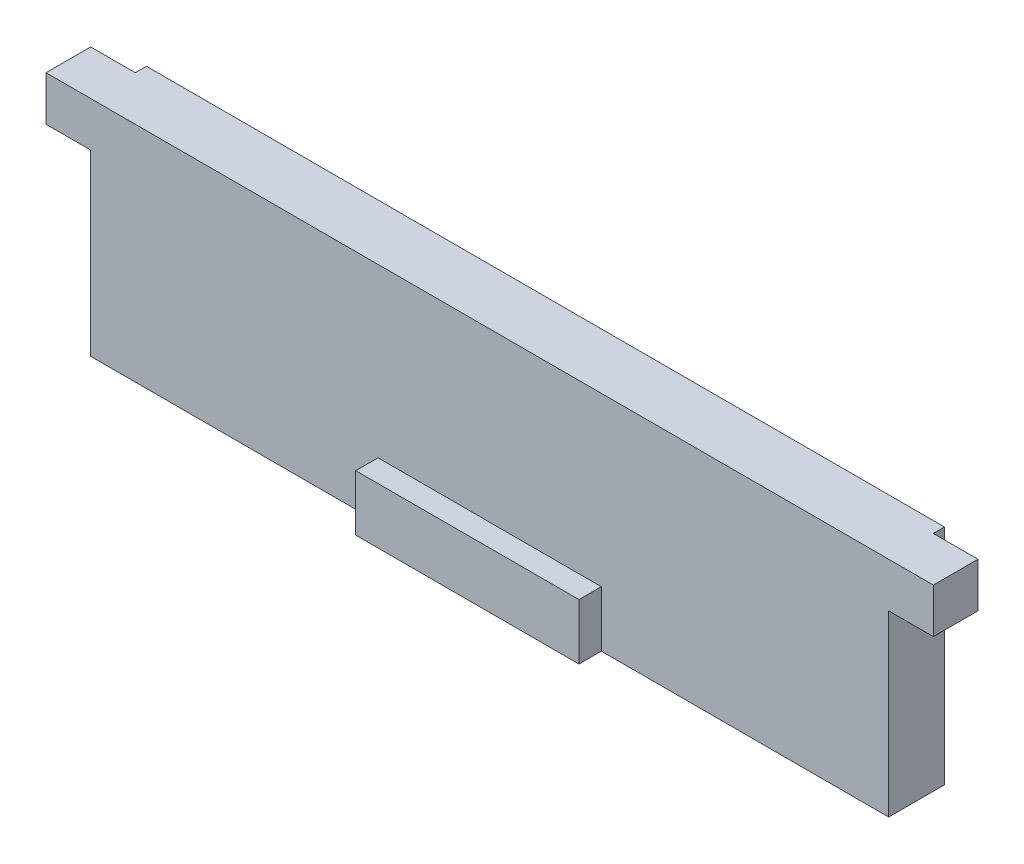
from build123d import *

# Parameters (mm, degrees)
SKETCH_1_W      = 71.485224
SKETCH_1_H      = 5
EXTRUDE_1_DEPTH = 20
SKETCH_3_W      = 10
SKETCH_3_H      = 5
EXTRUDE_3_DEPTH = 2
SKETCH_4_W      = 4
SKETCH_4_H      = 4
EXTRUDE_4_DEPTH = 4


with BuildPart() as part:
    # Sketch 1 → Extrude 1 (new body)
    with BuildSketch(Plane(origin=(0, 0, 0), x_dir=(1, 0, 0), z_dir=(0, 1, 0))):
        with Locations((35.742612, 2.5)):
            Rectangle(SKETCH_1_W, SKETCH_1_H)
    extrude(amount=EXTRUDE_1_DEPTH)

    # Sketch 3 → Extrude 3 (add)
    with BuildSketch(Plane.XY):
        with Locations((40.742612, 2.5)):
            Rectangle(SKETCH_3_W, SKETCH_3_H)
        with Locations((30.742612, 2.5)):
            Rectangle(SKETCH_3_W, SKETCH_3_H)
    extrude(amount=EXTRUDE_3_DEPTH)

    # Sketch 4 → Extrude 4 (add)
    with BuildSketch(Plane(origin=(0, 20, 0), x_dir=(1, 0, 0), z_dir=(0, 1, 0))):
        with Locations((-2, 2)):
            Rectangle(SKETCH_4_W, SKETCH_4_H)
        with Locations((73.485224, 2)):
            Rectangle(SKETCH_4_W, SKETCH_4_H)
    extrude(amount=-EXTRUDE_4_DEPTH)


solid = part.part
